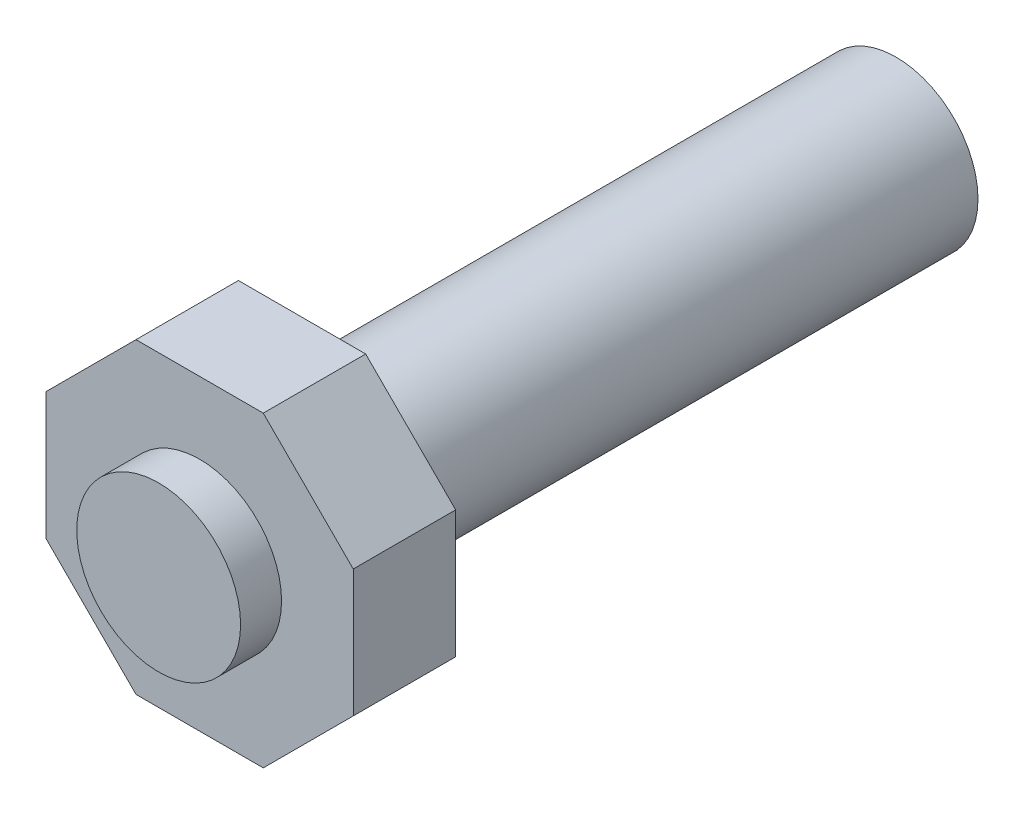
ISO-10303-21;
HEADER;
FILE_DESCRIPTION(('STEP AP214'),'2;1');
FILE_NAME('part.step','',(''),(''),'','','');
FILE_SCHEMA(('AUTOMOTIVE_DESIGN { 1 0 10303 214 1 1 1 1 }'));
ENDSEC;
DATA;
#1=APPLICATION_CONTEXT('core data for automotive mechanical design processes');
#2=APPLICATION_PROTOCOL_DEFINITION('international standard','automotive_design',2000,#1);
#3=PRODUCT_CONTEXT('',#1,'mechanical');
#4=PRODUCT('Part','Part','',(#3));
#5=PRODUCT_RELATED_PRODUCT_CATEGORY('part','',(#4));
#6=PRODUCT_DEFINITION_FORMATION('','',#4);
#7=PRODUCT_DEFINITION_CONTEXT('part definition',#1,'design');
#8=PRODUCT_DEFINITION('design','',#6,#7);
#9=PRODUCT_DEFINITION_SHAPE('','',#8);
#10=(LENGTH_UNIT() NAMED_UNIT(*) SI_UNIT(.MILLI.,.METRE.));
#11=(NAMED_UNIT(*) PLANE_ANGLE_UNIT() SI_UNIT($,.RADIAN.));
#12=(NAMED_UNIT(*) SI_UNIT($,.STERADIAN.) SOLID_ANGLE_UNIT());
#13=UNCERTAINTY_MEASURE_WITH_UNIT(LENGTH_MEASURE(1.E-05),#10,'distance_accuracy_value','');
#14=(GEOMETRIC_REPRESENTATION_CONTEXT(3) GLOBAL_UNCERTAINTY_ASSIGNED_CONTEXT((#13)) GLOBAL_UNIT_ASSIGNED_CONTEXT((#10,
#11,#12)) REPRESENTATION_CONTEXT('',''));
#15=CARTESIAN_POINT('',(0.,0.,0.));
#16=DIRECTION('',(0.,0.,1.));
#17=DIRECTION('',(1.,0.,0.));
#18=AXIS2_PLACEMENT_3D('',#15,#16,#17);
#19=CARTESIAN_POINT('',(8.,0.,58.));
#20=DIRECTION('',(0.,0.,1.));
#21=DIRECTION('',(1.,0.,0.));
#22=AXIS2_PLACEMENT_3D('',#19,#20,#21);
#23=PLANE('',#22);
#24=CARTESIAN_POINT('',(0.,0.,58.));
#25=DIRECTION('',(0.,0.,1.));
#26=DIRECTION('',(1.,0.,0.));
#27=AXIS2_PLACEMENT_3D('',#24,#25,#26);
#28=CIRCLE('',#27,8.);
#29=CARTESIAN_POINT('',(8.,0.,58.));
#30=VERTEX_POINT('',#29);
#31=EDGE_CURVE('E22',#30,#30,#28,.T.);
#32=ORIENTED_EDGE('',*,*,#31,.T.);
#33=EDGE_LOOP('',(#32));
#34=FACE_BOUND('',#33,.T.);
#35=DIRECTION('',(-0.707106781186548,-0.707106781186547,0.));
#36=VECTOR('',#35,1.);
#37=CARTESIAN_POINT('',(15.,-6.21320343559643,58.));
#38=LINE('',#37,#36);
#39=CARTESIAN_POINT('',(15.,-6.21320343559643,58.));
#40=VERTEX_POINT('',#39);
#41=CARTESIAN_POINT('',(6.21320343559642,-15.,58.));
#42=VERTEX_POINT('',#41);
#43=EDGE_CURVE('E91',#40,#42,#38,.T.);
#44=ORIENTED_EDGE('',*,*,#43,.T.);
#45=DIRECTION('',(1.,0.,0.));
#46=VECTOR('',#45,1.);
#47=CARTESIAN_POINT('',(-6.21320343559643,-15.,58.));
#48=LINE('',#47,#46);
#49=CARTESIAN_POINT('',(-6.21320343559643,-15.,58.));
#50=VERTEX_POINT('',#49);
#51=EDGE_CURVE('E97',#50,#42,#48,.T.);
#52=ORIENTED_EDGE('',*,*,#51,.F.);
#53=DIRECTION('',(0.707106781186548,-0.707106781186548,0.));
#54=VECTOR('',#53,1.);
#55=CARTESIAN_POINT('',(-15.,-6.21320343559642,58.));
#56=LINE('',#55,#54);
#57=CARTESIAN_POINT('',(-15.,-6.21320343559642,58.));
#58=VERTEX_POINT('',#57);
#59=EDGE_CURVE('E29',#58,#50,#56,.T.);
#60=ORIENTED_EDGE('',*,*,#59,.F.);
#61=DIRECTION('',(0.,-1.,0.));
#62=VECTOR('',#61,1.);
#63=CARTESIAN_POINT('',(-15.,6.21320343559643,58.));
#64=LINE('',#63,#62);
#65=CARTESIAN_POINT('',(-15.,6.21320343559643,58.));
#66=VERTEX_POINT('',#65);
#67=EDGE_CURVE('E111',#66,#58,#64,.T.);
#68=ORIENTED_EDGE('',*,*,#67,.F.);
#69=DIRECTION('',(0.707106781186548,0.707106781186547,0.));
#70=VECTOR('',#69,1.);
#71=CARTESIAN_POINT('',(-15.,6.21320343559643,58.));
#72=LINE('',#71,#70);
#73=CARTESIAN_POINT('',(-6.21320343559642,15.,58.));
#74=VERTEX_POINT('',#73);
#75=EDGE_CURVE('E108',#66,#74,#72,.T.);
#76=ORIENTED_EDGE('',*,*,#75,.T.);
#77=DIRECTION('',(1.,0.,0.));
#78=VECTOR('',#77,1.);
#79=CARTESIAN_POINT('',(-6.21320343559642,15.,58.));
#80=LINE('',#79,#78);
#81=CARTESIAN_POINT('',(6.21320343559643,15.,58.));
#82=VERTEX_POINT('',#81);
#83=EDGE_CURVE('E103',#74,#82,#80,.T.);
#84=ORIENTED_EDGE('',*,*,#83,.T.);
#85=DIRECTION('',(0.707106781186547,-0.707106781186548,0.));
#86=VECTOR('',#85,1.);
#87=CARTESIAN_POINT('',(6.21320343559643,15.,58.));
#88=LINE('',#87,#86);
#89=CARTESIAN_POINT('',(15.,6.21320343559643,58.));
#90=VERTEX_POINT('',#89);
#91=EDGE_CURVE('E101',#82,#90,#88,.T.);
#92=ORIENTED_EDGE('',*,*,#91,.T.);
#93=DIRECTION('',(0.,-1.,0.));
#94=VECTOR('',#93,1.);
#95=CARTESIAN_POINT('',(15.,6.21320343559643,58.));
#96=LINE('',#95,#94);
#97=EDGE_CURVE('E83',#90,#40,#96,.T.);
#98=ORIENTED_EDGE('',*,*,#97,.T.);
#99=EDGE_LOOP('',(#44,#52,#60,#68,#76,#84,#92,#98));
#100=FACE_BOUND('',#99,.T.);
#101=ADVANCED_FACE('F14',(#34,#100),#23,.F.);
#102=CARTESIAN_POINT('',(0.,0.,0.));
#103=DIRECTION('',(0.,0.,1.));
#104=DIRECTION('',(1.,0.,0.));
#105=AXIS2_PLACEMENT_3D('',#102,#103,#104);
#106=PLANE('',#105);
#107=CARTESIAN_POINT('',(0.,0.,0.));
#108=DIRECTION('',(0.,0.,1.));
#109=DIRECTION('',(1.,0.,0.));
#110=AXIS2_PLACEMENT_3D('',#107,#108,#109);
#111=CIRCLE('',#110,8.);
#112=CARTESIAN_POINT('',(8.,0.,0.));
#113=VERTEX_POINT('',#112);
#114=EDGE_CURVE('E9',#113,#113,#111,.T.);
#115=ORIENTED_EDGE('',*,*,#114,.F.);
#116=EDGE_LOOP('',(#115));
#117=FACE_BOUND('',#116,.T.);
#118=ADVANCED_FACE('F16',(#117),#106,.F.);
#119=CARTESIAN_POINT('',(0.,0.,80.));
#120=DIRECTION('',(0.,0.,1.));
#121=DIRECTION('',(1.,0.,0.));
#122=AXIS2_PLACEMENT_3D('',#119,#120,#121);
#123=CYLINDRICAL_SURFACE('',#122,8.);
#124=ORIENTED_EDGE('',*,*,#31,.F.);
#125=EDGE_LOOP('',(#124));
#126=FACE_BOUND('',#125,.T.);
#127=ORIENTED_EDGE('',*,*,#114,.T.);
#128=EDGE_LOOP('',(#127));
#129=FACE_BOUND('',#128,.T.);
#130=ADVANCED_FACE('F155',(#126,#129),#123,.T.);
#131=CARTESIAN_POINT('',(15.,-6.21320343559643,68.));
#132=DIRECTION('',(0.707106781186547,-0.707106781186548,0.));
#133=DIRECTION('',(0.707106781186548,0.707106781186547,0.));
#134=AXIS2_PLACEMENT_3D('',#131,#132,#133);
#135=PLANE('',#134);
#136=DIRECTION('',(0.,0.,-1.));
#137=VECTOR('',#136,1.);
#138=CARTESIAN_POINT('',(15.,-6.21320343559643,68.));
#139=LINE('',#138,#137);
#140=CARTESIAN_POINT('',(15.,-6.21320343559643,68.));
#141=VERTEX_POINT('',#140);
#142=EDGE_CURVE('E79',#141,#40,#139,.T.);
#143=ORIENTED_EDGE('',*,*,#142,.F.);
#144=DIRECTION('',(-0.707106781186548,-0.707106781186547,0.));
#145=VECTOR('',#144,1.);
#146=CARTESIAN_POINT('',(15.,-6.21320343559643,68.));
#147=LINE('',#146,#145);
#148=CARTESIAN_POINT('',(6.21320343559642,-15.,68.));
#149=VERTEX_POINT('',#148);
#150=EDGE_CURVE('E37',#141,#149,#147,.T.);
#151=ORIENTED_EDGE('',*,*,#150,.T.);
#152=DIRECTION('',(0.,0.,-1.));
#153=VECTOR('',#152,1.);
#154=CARTESIAN_POINT('',(6.21320343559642,-15.,68.));
#155=LINE('',#154,#153);
#156=EDGE_CURVE('E93',#149,#42,#155,.T.);
#157=ORIENTED_EDGE('',*,*,#156,.T.);
#158=ORIENTED_EDGE('',*,*,#43,.F.);
#159=EDGE_LOOP('',(#143,#151,#157,#158));
#160=FACE_BOUND('',#159,.T.);
#161=ADVANCED_FACE('F92',(#160),#135,.T.);
#162=CARTESIAN_POINT('',(15.,6.21320343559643,68.));
#163=DIRECTION('',(1.,0.,0.));
#164=DIRECTION('',(0.,0.,-1.));
#165=AXIS2_PLACEMENT_3D('',#162,#163,#164);
#166=PLANE('',#165);
#167=DIRECTION('',(0.,0.,-1.));
#168=VECTOR('',#167,1.);
#169=CARTESIAN_POINT('',(15.,6.21320343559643,68.));
#170=LINE('',#169,#168);
#171=CARTESIAN_POINT('',(15.,6.21320343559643,68.));
#172=VERTEX_POINT('',#171);
#173=EDGE_CURVE('E88',#172,#90,#170,.T.);
#174=ORIENTED_EDGE('',*,*,#173,.F.);
#175=DIRECTION('',(0.,-1.,0.));
#176=VECTOR('',#175,1.);
#177=CARTESIAN_POINT('',(15.,6.21320343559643,68.));
#178=LINE('',#177,#176);
#179=EDGE_CURVE('E86',#172,#141,#178,.T.);
#180=ORIENTED_EDGE('',*,*,#179,.T.);
#181=ORIENTED_EDGE('',*,*,#142,.T.);
#182=ORIENTED_EDGE('',*,*,#97,.F.);
#183=EDGE_LOOP('',(#174,#180,#181,#182));
#184=FACE_BOUND('',#183,.T.);
#185=ADVANCED_FACE('F81',(#184),#166,.T.);
#186=CARTESIAN_POINT('',(6.21320343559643,15.,68.));
#187=DIRECTION('',(0.707106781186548,0.707106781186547,0.));
#188=DIRECTION('',(-0.707106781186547,0.707106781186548,0.));
#189=AXIS2_PLACEMENT_3D('',#186,#187,#188);
#190=PLANE('',#189);
#191=DIRECTION('',(0.,0.,-1.));
#192=VECTOR('',#191,1.);
#193=CARTESIAN_POINT('',(6.21320343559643,15.,68.));
#194=LINE('',#193,#192);
#195=CARTESIAN_POINT('',(6.21320343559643,15.,68.));
#196=VERTEX_POINT('',#195);
#197=EDGE_CURVE('E144',#196,#82,#194,.T.);
#198=ORIENTED_EDGE('',*,*,#197,.F.);
#199=DIRECTION('',(0.707106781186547,-0.707106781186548,0.));
#200=VECTOR('',#199,1.);
#201=CARTESIAN_POINT('',(6.21320343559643,15.,68.));
#202=LINE('',#201,#200);
#203=EDGE_CURVE('E124',#196,#172,#202,.T.);
#204=ORIENTED_EDGE('',*,*,#203,.T.);
#205=ORIENTED_EDGE('',*,*,#173,.T.);
#206=ORIENTED_EDGE('',*,*,#91,.F.);
#207=EDGE_LOOP('',(#198,#204,#205,#206));
#208=FACE_BOUND('',#207,.T.);
#209=ADVANCED_FACE('F186',(#208),#190,.T.);
#210=CARTESIAN_POINT('',(-6.21320343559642,15.,68.));
#211=DIRECTION('',(0.,1.,0.));
#212=DIRECTION('',(-1.,0.,0.));
#213=AXIS2_PLACEMENT_3D('',#210,#211,#212);
#214=PLANE('',#213);
#215=DIRECTION('',(0.,0.,-1.));
#216=VECTOR('',#215,1.);
#217=CARTESIAN_POINT('',(-6.21320343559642,15.,68.));
#218=LINE('',#217,#216);
#219=CARTESIAN_POINT('',(-6.21320343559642,15.,68.));
#220=VERTEX_POINT('',#219);
#221=EDGE_CURVE('E142',#220,#74,#218,.T.);
#222=ORIENTED_EDGE('',*,*,#221,.F.);
#223=DIRECTION('',(1.,0.,0.));
#224=VECTOR('',#223,1.);
#225=CARTESIAN_POINT('',(-6.21320343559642,15.,68.));
#226=LINE('',#225,#224);
#227=EDGE_CURVE('E128',#220,#196,#226,.T.);
#228=ORIENTED_EDGE('',*,*,#227,.T.);
#229=ORIENTED_EDGE('',*,*,#197,.T.);
#230=ORIENTED_EDGE('',*,*,#83,.F.);
#231=EDGE_LOOP('',(#222,#228,#229,#230));
#232=FACE_BOUND('',#231,.T.);
#233=ADVANCED_FACE('F189',(#232),#214,.T.);
#234=CARTESIAN_POINT('',(-15.,6.21320343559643,68.));
#235=DIRECTION('',(-0.707106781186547,0.707106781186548,0.));
#236=DIRECTION('',(-0.707106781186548,-0.707106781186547,0.));
#237=AXIS2_PLACEMENT_3D('',#234,#235,#236);
#238=PLANE('',#237);
#239=DIRECTION('',(0.,0.,-1.));
#240=VECTOR('',#239,1.);
#241=CARTESIAN_POINT('',(-15.,6.21320343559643,68.));
#242=LINE('',#241,#240);
#243=CARTESIAN_POINT('',(-15.,6.21320343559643,68.));
#244=VERTEX_POINT('',#243);
#245=EDGE_CURVE('E140',#244,#66,#242,.T.);
#246=ORIENTED_EDGE('',*,*,#245,.F.);
#247=DIRECTION('',(0.707106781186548,0.707106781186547,0.));
#248=VECTOR('',#247,1.);
#249=CARTESIAN_POINT('',(-15.,6.21320343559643,68.));
#250=LINE('',#249,#248);
#251=EDGE_CURVE('E125',#244,#220,#250,.T.);
#252=ORIENTED_EDGE('',*,*,#251,.T.);
#253=ORIENTED_EDGE('',*,*,#221,.T.);
#254=ORIENTED_EDGE('',*,*,#75,.F.);
#255=EDGE_LOOP('',(#246,#252,#253,#254));
#256=FACE_BOUND('',#255,.T.);
#257=ADVANCED_FACE('F193',(#256),#238,.T.);
#258=CARTESIAN_POINT('',(-15.,6.21320343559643,68.));
#259=DIRECTION('',(1.,0.,0.));
#260=DIRECTION('',(0.,1.,0.));
#261=AXIS2_PLACEMENT_3D('',#258,#259,#260);
#262=PLANE('',#261);
#263=DIRECTION('',(0.,0.,-1.));
#264=VECTOR('',#263,1.);
#265=CARTESIAN_POINT('',(-15.,-6.21320343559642,68.));
#266=LINE('',#265,#264);
#267=CARTESIAN_POINT('',(-15.,-6.21320343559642,68.));
#268=VERTEX_POINT('',#267);
#269=EDGE_CURVE('E138',#268,#58,#266,.T.);
#270=ORIENTED_EDGE('',*,*,#269,.F.);
#271=DIRECTION('',(0.,-1.,0.));
#272=VECTOR('',#271,1.);
#273=CARTESIAN_POINT('',(-15.,6.21320343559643,68.));
#274=LINE('',#273,#272);
#275=EDGE_CURVE('E122',#244,#268,#274,.T.);
#276=ORIENTED_EDGE('',*,*,#275,.F.);
#277=ORIENTED_EDGE('',*,*,#245,.T.);
#278=ORIENTED_EDGE('',*,*,#67,.T.);
#279=EDGE_LOOP('',(#270,#276,#277,#278));
#280=FACE_BOUND('',#279,.T.);
#281=ADVANCED_FACE('F197',(#280),#262,.F.);
#282=CARTESIAN_POINT('',(-15.,-6.21320343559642,68.));
#283=DIRECTION('',(0.707106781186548,0.707106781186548,0.));
#284=DIRECTION('',(-0.707106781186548,0.707106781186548,0.));
#285=AXIS2_PLACEMENT_3D('',#282,#283,#284);
#286=PLANE('',#285);
#287=DIRECTION('',(0.,0.,-1.));
#288=VECTOR('',#287,1.);
#289=CARTESIAN_POINT('',(-6.21320343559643,-15.,68.));
#290=LINE('',#289,#288);
#291=CARTESIAN_POINT('',(-6.21320343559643,-15.,68.));
#292=VERTEX_POINT('',#291);
#293=EDGE_CURVE('E136',#292,#50,#290,.T.);
#294=ORIENTED_EDGE('',*,*,#293,.F.);
#295=DIRECTION('',(0.707106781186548,-0.707106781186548,0.));
#296=VECTOR('',#295,1.);
#297=CARTESIAN_POINT('',(-15.,-6.21320343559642,68.));
#298=LINE('',#297,#296);
#299=EDGE_CURVE('E119',#268,#292,#298,.T.);
#300=ORIENTED_EDGE('',*,*,#299,.F.);
#301=ORIENTED_EDGE('',*,*,#269,.T.);
#302=ORIENTED_EDGE('',*,*,#59,.T.);
#303=EDGE_LOOP('',(#294,#300,#301,#302));
#304=FACE_BOUND('',#303,.T.);
#305=ADVANCED_FACE('F201',(#304),#286,.F.);
#306=CARTESIAN_POINT('',(-6.21320343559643,-15.,68.));
#307=DIRECTION('',(0.,1.,0.));
#308=DIRECTION('',(0.,0.,1.));
#309=AXIS2_PLACEMENT_3D('',#306,#307,#308);
#310=PLANE('',#309);
#311=DIRECTION('',(1.,0.,0.));
#312=VECTOR('',#311,1.);
#313=CARTESIAN_POINT('',(-6.21320343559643,-15.,68.));
#314=LINE('',#313,#312);
#315=EDGE_CURVE('E116',#292,#149,#314,.T.);
#316=ORIENTED_EDGE('',*,*,#315,.F.);
#317=ORIENTED_EDGE('',*,*,#293,.T.);
#318=ORIENTED_EDGE('',*,*,#51,.T.);
#319=ORIENTED_EDGE('',*,*,#156,.F.);
#320=EDGE_LOOP('',(#316,#317,#318,#319));
#321=FACE_BOUND('',#320,.T.);
#322=ADVANCED_FACE('F182',(#321),#310,.F.);
#323=CARTESIAN_POINT('',(8.,0.,72.));
#324=DIRECTION('',(0.,0.,-1.));
#325=DIRECTION('',(-1.,0.,0.));
#326=AXIS2_PLACEMENT_3D('',#323,#324,#325);
#327=PLANE('',#326);
#328=CARTESIAN_POINT('',(0.,0.,72.));
#329=DIRECTION('',(0.,0.,1.));
#330=DIRECTION('',(1.,0.,0.));
#331=AXIS2_PLACEMENT_3D('',#328,#329,#330);
#332=CIRCLE('',#331,8.);
#333=CARTESIAN_POINT('',(8.,0.,72.));
#334=VERTEX_POINT('',#333);
#335=EDGE_CURVE('E87',#334,#334,#332,.T.);
#336=ORIENTED_EDGE('',*,*,#335,.T.);
#337=EDGE_LOOP('',(#336));
#338=FACE_BOUND('',#337,.T.);
#339=ADVANCED_FACE('F178',(#338),#327,.F.);
#340=CARTESIAN_POINT('',(0.,0.,80.));
#341=DIRECTION('',(0.,0.,1.));
#342=DIRECTION('',(1.,0.,0.));
#343=AXIS2_PLACEMENT_3D('',#340,#341,#342);
#344=CYLINDRICAL_SURFACE('',#343,8.);
#345=ORIENTED_EDGE('',*,*,#335,.F.);
#346=EDGE_LOOP('',(#345));
#347=FACE_BOUND('',#346,.T.);
#348=CARTESIAN_POINT('',(0.,0.,68.));
#349=DIRECTION('',(0.,0.,1.));
#350=DIRECTION('',(1.,0.,0.));
#351=AXIS2_PLACEMENT_3D('',#348,#349,#350);
#352=CIRCLE('',#351,8.);
#353=CARTESIAN_POINT('',(8.,0.,68.));
#354=VERTEX_POINT('',#353);
#355=EDGE_CURVE('E149',#354,#354,#352,.T.);
#356=ORIENTED_EDGE('',*,*,#355,.T.);
#357=EDGE_LOOP('',(#356));
#358=FACE_BOUND('',#357,.T.);
#359=ADVANCED_FACE('F174',(#347,#358),#344,.T.);
#360=CARTESIAN_POINT('',(17.,0.,68.));
#361=DIRECTION('',(0.,0.,-1.));
#362=DIRECTION('',(-1.,0.,0.));
#363=AXIS2_PLACEMENT_3D('',#360,#361,#362);
#364=PLANE('',#363);
#365=ORIENTED_EDGE('',*,*,#355,.F.);
#366=EDGE_LOOP('',(#365));
#367=FACE_BOUND('',#366,.T.);
#368=ORIENTED_EDGE('',*,*,#150,.F.);
#369=ORIENTED_EDGE('',*,*,#179,.F.);
#370=ORIENTED_EDGE('',*,*,#203,.F.);
#371=ORIENTED_EDGE('',*,*,#227,.F.);
#372=ORIENTED_EDGE('',*,*,#251,.F.);
#373=ORIENTED_EDGE('',*,*,#275,.T.);
#374=ORIENTED_EDGE('',*,*,#299,.T.);
#375=ORIENTED_EDGE('',*,*,#315,.T.);
#376=EDGE_LOOP('',(#368,#369,#370,#371,#372,#373,#374,#375));
#377=FACE_BOUND('',#376,.T.);
#378=ADVANCED_FACE('F171',(#367,#377),#364,.F.);
#379=CLOSED_SHELL('',(#101,#118,#130,#161,#185,#209,#233,#257,#281,#305,#322,#339,#359,#378));
#380=MANIFOLD_SOLID_BREP('B1',#379);
#381=ADVANCED_BREP_SHAPE_REPRESENTATION('',(#18,#380),#14);
#382=SHAPE_DEFINITION_REPRESENTATION(#9,#381);
ENDSEC;
END-ISO-10303-21;
